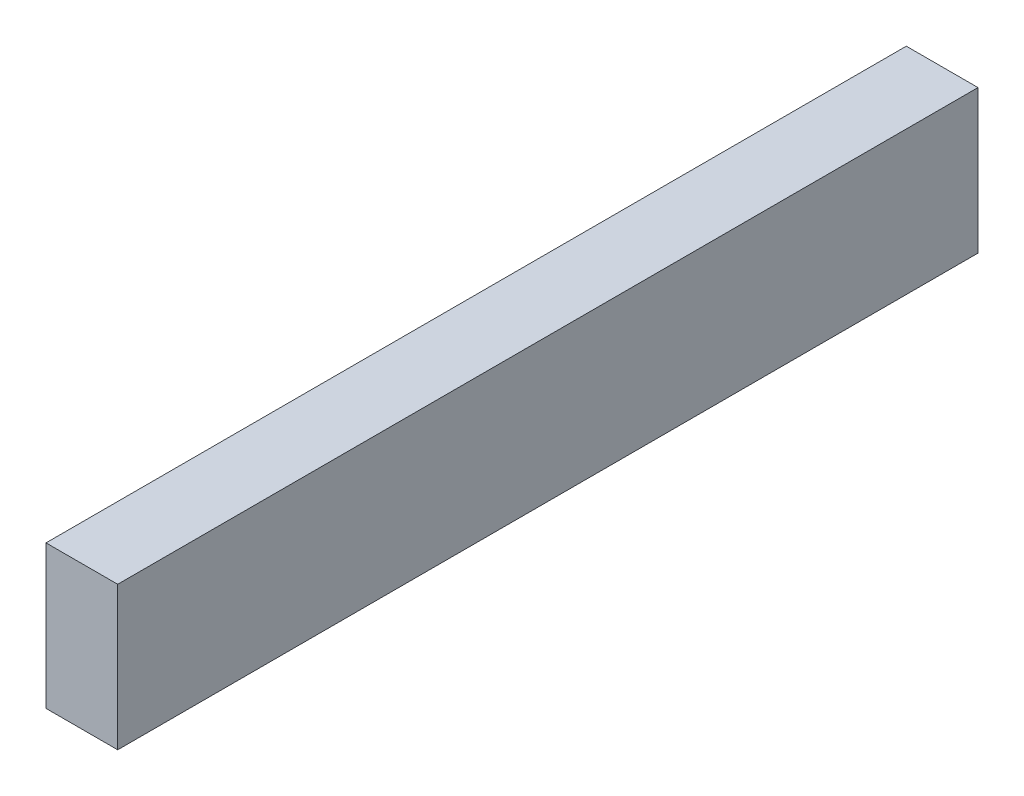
from build123d import *

# Parameters (mm, degrees)
ESQUISSE1_W      = 5
ESQUISSE1_H      = 10
EXTRUSION1_DEPTH = 30


with BuildPart() as part:
    # Esquisse1 → Extrusion1 (new, symmetric)
    with BuildSketch(Plane.XY):
        Rectangle(ESQUISSE1_W, ESQUISSE1_H)
    extrude(amount=EXTRUSION1_DEPTH, both=True)


solid = part.part
